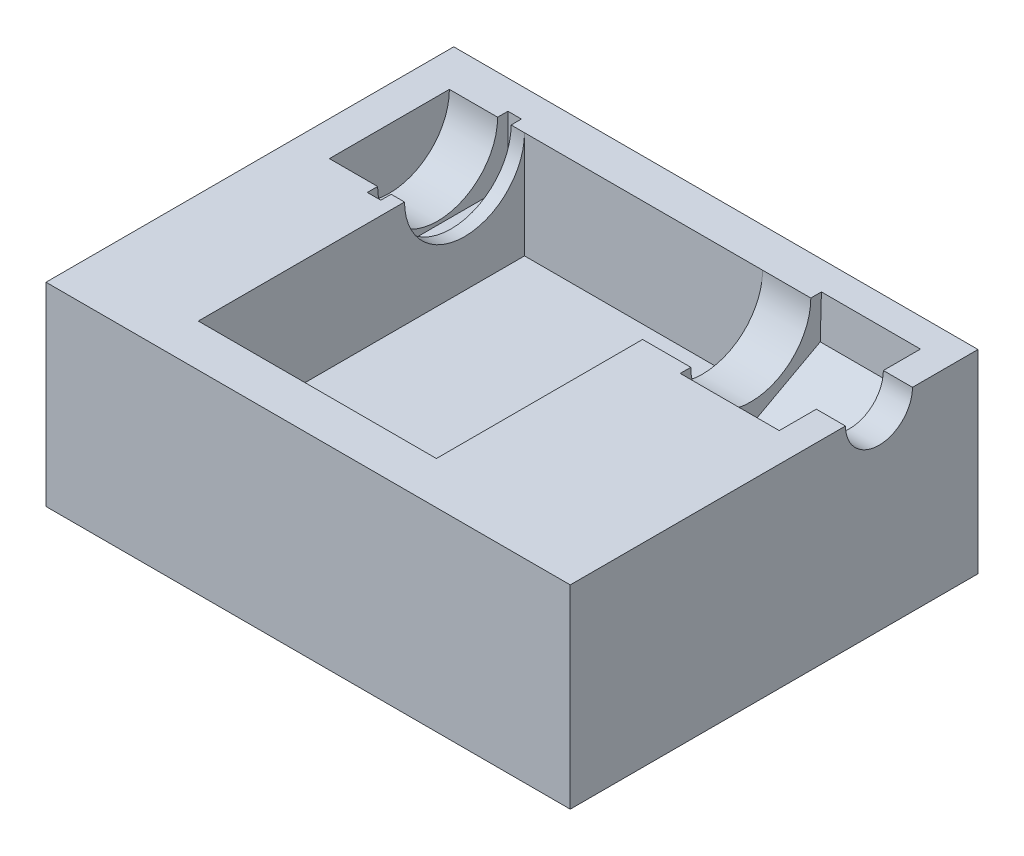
ISO-10303-21;
HEADER;
FILE_DESCRIPTION(('STEP AP214'),'2;1');
FILE_NAME('part.step','',(''),(''),'','','');
FILE_SCHEMA(('AUTOMOTIVE_DESIGN { 1 0 10303 214 1 1 1 1 }'));
ENDSEC;
DATA;
#1=APPLICATION_CONTEXT('core data for automotive mechanical design processes');
#2=APPLICATION_PROTOCOL_DEFINITION('international standard','automotive_design',2000,#1);
#3=PRODUCT_CONTEXT('',#1,'mechanical');
#4=PRODUCT('Part','Part','',(#3));
#5=PRODUCT_RELATED_PRODUCT_CATEGORY('part','',(#4));
#6=PRODUCT_DEFINITION_FORMATION('','',#4);
#7=PRODUCT_DEFINITION_CONTEXT('part definition',#1,'design');
#8=PRODUCT_DEFINITION('design','',#6,#7);
#9=PRODUCT_DEFINITION_SHAPE('','',#8);
#10=(LENGTH_UNIT() NAMED_UNIT(*) SI_UNIT(.MILLI.,.METRE.));
#11=(NAMED_UNIT(*) PLANE_ANGLE_UNIT() SI_UNIT($,.RADIAN.));
#12=(NAMED_UNIT(*) SI_UNIT($,.STERADIAN.) SOLID_ANGLE_UNIT());
#13=UNCERTAINTY_MEASURE_WITH_UNIT(LENGTH_MEASURE(1.E-05),#10,'distance_accuracy_value','');
#14=(GEOMETRIC_REPRESENTATION_CONTEXT(3) GLOBAL_UNCERTAINTY_ASSIGNED_CONTEXT((#13)) GLOBAL_UNIT_ASSIGNED_CONTEXT((#10,
#11,#12)) REPRESENTATION_CONTEXT('',''));
#15=CARTESIAN_POINT('',(0.,0.,0.));
#16=DIRECTION('',(0.,0.,1.));
#17=DIRECTION('',(1.,0.,0.));
#18=AXIS2_PLACEMENT_3D('',#15,#16,#17);
#19=CARTESIAN_POINT('',(45.,33.35,35.));
#20=DIRECTION('',(-1.,0.,0.));
#21=DIRECTION('',(0.,0.,1.));
#22=AXIS2_PLACEMENT_3D('',#19,#20,#21);
#23=PLANE('',#22);
#24=DIRECTION('',(0.,0.,-1.));
#25=VECTOR('',#24,1.);
#26=CARTESIAN_POINT('',(45.,33.35,35.));
#27=LINE('',#26,#25);
#28=CARTESIAN_POINT('',(45.,33.35,-23.75));
#29=VERTEX_POINT('',#28);
#30=CARTESIAN_POINT('',(45.,33.35,-35.));
#31=VERTEX_POINT('',#30);
#32=EDGE_CURVE('E324',#29,#31,#27,.T.);
#33=ORIENTED_EDGE('',*,*,#32,.F.);
#34=CARTESIAN_POINT('',(45.,33.35,-18.));
#35=DIRECTION('',(1.,0.,0.));
#36=DIRECTION('',(0.,0.,-1.));
#37=AXIS2_PLACEMENT_3D('',#34,#35,#36);
#38=CIRCLE('',#37,5.74999999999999);
#39=CARTESIAN_POINT('',(45.,33.35,-12.25));
#40=VERTEX_POINT('',#39);
#41=EDGE_CURVE('E318',#40,#29,#38,.T.);
#42=ORIENTED_EDGE('',*,*,#41,.F.);
#43=CARTESIAN_POINT('',(45.,33.35,35.));
#44=VERTEX_POINT('',#43);
#45=EDGE_CURVE('E320',#44,#40,#27,.T.);
#46=ORIENTED_EDGE('',*,*,#45,.F.);
#47=DIRECTION('',(0.,-1.,0.));
#48=VECTOR('',#47,1.);
#49=CARTESIAN_POINT('',(45.,33.35,35.));
#50=LINE('',#49,#48);
#51=CARTESIAN_POINT('',(45.,0.,35.));
#52=VERTEX_POINT('',#51);
#53=EDGE_CURVE('E330',#44,#52,#50,.T.);
#54=ORIENTED_EDGE('',*,*,#53,.T.);
#55=DIRECTION('',(0.,0.,-1.));
#56=VECTOR('',#55,1.);
#57=CARTESIAN_POINT('',(45.,0.,35.));
#58=LINE('',#57,#56);
#59=CARTESIAN_POINT('',(45.,0.,-35.));
#60=VERTEX_POINT('',#59);
#61=EDGE_CURVE('E317',#52,#60,#58,.T.);
#62=ORIENTED_EDGE('',*,*,#61,.T.);
#63=DIRECTION('',(0.,-1.,0.));
#64=VECTOR('',#63,1.);
#65=CARTESIAN_POINT('',(45.,33.35,-35.));
#66=LINE('',#65,#64);
#67=EDGE_CURVE('E347',#31,#60,#66,.T.);
#68=ORIENTED_EDGE('',*,*,#67,.F.);
#69=EDGE_LOOP('',(#33,#42,#46,#54,#62,#68));
#70=FACE_BOUND('',#69,.T.);
#71=ADVANCED_FACE('F34',(#70),#23,.F.);
#72=CARTESIAN_POINT('',(-45.,33.35,-35.));
#73=DIRECTION('',(0.,0.,1.));
#74=DIRECTION('',(1.,0.,0.));
#75=AXIS2_PLACEMENT_3D('',#72,#73,#74);
#76=PLANE('',#75);
#77=DIRECTION('',(-1.,0.,0.));
#78=VECTOR('',#77,1.);
#79=CARTESIAN_POINT('',(-45.,0.,-35.));
#80=LINE('',#79,#78);
#81=CARTESIAN_POINT('',(-45.,0.,-35.));
#82=VERTEX_POINT('',#81);
#83=EDGE_CURVE('E333',#60,#82,#80,.T.);
#84=ORIENTED_EDGE('',*,*,#83,.T.);
#85=DIRECTION('',(0.,-1.,0.));
#86=VECTOR('',#85,1.);
#87=CARTESIAN_POINT('',(-45.,33.35,-35.));
#88=LINE('',#87,#86);
#89=CARTESIAN_POINT('',(-45.,33.35,-35.));
#90=VERTEX_POINT('',#89);
#91=EDGE_CURVE('E344',#90,#82,#88,.T.);
#92=ORIENTED_EDGE('',*,*,#91,.F.);
#93=DIRECTION('',(-1.,0.,0.));
#94=VECTOR('',#93,1.);
#95=CARTESIAN_POINT('',(-45.,33.35,-35.));
#96=LINE('',#95,#94);
#97=EDGE_CURVE('E323',#31,#90,#96,.T.);
#98=ORIENTED_EDGE('',*,*,#97,.F.);
#99=ORIENTED_EDGE('',*,*,#67,.T.);
#100=EDGE_LOOP('',(#84,#92,#98,#99));
#101=FACE_BOUND('',#100,.T.);
#102=ADVANCED_FACE('F463',(#101),#76,.F.);
#103=CARTESIAN_POINT('',(-45.,33.35,35.));
#104=DIRECTION('',(1.,0.,0.));
#105=DIRECTION('',(0.,0.,-1.));
#106=AXIS2_PLACEMENT_3D('',#103,#104,#105);
#107=PLANE('',#106);
#108=DIRECTION('',(0.,0.,1.));
#109=VECTOR('',#108,1.);
#110=CARTESIAN_POINT('',(-45.,0.,35.));
#111=LINE('',#110,#109);
#112=CARTESIAN_POINT('',(-45.,0.,35.));
#113=VERTEX_POINT('',#112);
#114=EDGE_CURVE('E335',#82,#113,#111,.T.);
#115=ORIENTED_EDGE('',*,*,#114,.T.);
#116=DIRECTION('',(0.,-1.,0.));
#117=VECTOR('',#116,1.);
#118=CARTESIAN_POINT('',(-45.,33.35,35.));
#119=LINE('',#118,#117);
#120=CARTESIAN_POINT('',(-45.,33.35,35.));
#121=VERTEX_POINT('',#120);
#122=EDGE_CURVE('E341',#121,#113,#119,.T.);
#123=ORIENTED_EDGE('',*,*,#122,.F.);
#124=DIRECTION('',(0.,0.,1.));
#125=VECTOR('',#124,1.);
#126=CARTESIAN_POINT('',(-45.,33.35,35.));
#127=LINE('',#126,#125);
#128=EDGE_CURVE('E326',#90,#121,#127,.T.);
#129=ORIENTED_EDGE('',*,*,#128,.F.);
#130=ORIENTED_EDGE('',*,*,#91,.T.);
#131=EDGE_LOOP('',(#115,#123,#129,#130));
#132=FACE_BOUND('',#131,.T.);
#133=ADVANCED_FACE('F465',(#132),#107,.F.);
#134=CARTESIAN_POINT('',(-45.,33.35,35.));
#135=DIRECTION('',(0.,0.,-1.));
#136=DIRECTION('',(-1.,0.,0.));
#137=AXIS2_PLACEMENT_3D('',#134,#135,#136);
#138=PLANE('',#137);
#139=DIRECTION('',(1.,0.,0.));
#140=VECTOR('',#139,1.);
#141=CARTESIAN_POINT('',(-45.,0.,35.));
#142=LINE('',#141,#140);
#143=EDGE_CURVE('E337',#113,#52,#142,.T.);
#144=ORIENTED_EDGE('',*,*,#143,.T.);
#145=ORIENTED_EDGE('',*,*,#53,.F.);
#146=DIRECTION('',(1.,0.,0.));
#147=VECTOR('',#146,1.);
#148=CARTESIAN_POINT('',(-45.,33.35,35.));
#149=LINE('',#148,#147);
#150=EDGE_CURVE('E328',#121,#44,#149,.T.);
#151=ORIENTED_EDGE('',*,*,#150,.F.);
#152=ORIENTED_EDGE('',*,*,#122,.T.);
#153=EDGE_LOOP('',(#144,#145,#151,#152));
#154=FACE_BOUND('',#153,.T.);
#155=ADVANCED_FACE('F454',(#154),#138,.F.);
#156=CARTESIAN_POINT('',(0.,33.35,0.));
#157=DIRECTION('',(0.,-1.,0.));
#158=DIRECTION('',(0.,0.,-1.));
#159=AXIS2_PLACEMENT_3D('',#156,#157,#158);
#160=PLANE('',#159);
#161=DIRECTION('',(0.,0.,1.));
#162=VECTOR('',#161,1.);
#163=CARTESIAN_POINT('',(-39.05,33.35,0.));
#164=LINE('',#163,#162);
#165=CARTESIAN_POINT('',(-39.05,33.35,-28.3));
#166=VERTEX_POINT('',#165);
#167=CARTESIAN_POINT('',(-39.05,33.35,-7.7));
#168=VERTEX_POINT('',#167);
#169=EDGE_CURVE('E11',#166,#168,#164,.T.);
#170=ORIENTED_EDGE('',*,*,#169,.F.);
#171=DIRECTION('',(1.,0.,0.));
#172=VECTOR('',#171,1.);
#173=CARTESIAN_POINT('',(-39.05,33.35,-28.3));
#174=LINE('',#173,#172);
#175=CARTESIAN_POINT('',(-30.77,33.35,-28.3));
#176=VERTEX_POINT('',#175);
#177=EDGE_CURVE('E193',#166,#176,#174,.T.);
#178=ORIENTED_EDGE('',*,*,#177,.T.);
#179=DIRECTION('',(0.,0.,1.));
#180=VECTOR('',#179,1.);
#181=CARTESIAN_POINT('',(-30.77,33.35,0.));
#182=LINE('',#181,#180);
#183=CARTESIAN_POINT('',(-30.77,33.35,-30.07));
#184=VERTEX_POINT('',#183);
#185=EDGE_CURVE('E372',#184,#176,#182,.T.);
#186=ORIENTED_EDGE('',*,*,#185,.F.);
#187=DIRECTION('',(1.,0.,0.));
#188=VECTOR('',#187,1.);
#189=CARTESIAN_POINT('',(0.,33.35,-30.07));
#190=LINE('',#189,#188);
#191=CARTESIAN_POINT('',(-28.45,33.35,-30.07));
#192=VERTEX_POINT('',#191);
#193=EDGE_CURVE('E374',#184,#192,#190,.T.);
#194=ORIENTED_EDGE('',*,*,#193,.T.);
#195=DIRECTION('',(0.,0.,1.));
#196=VECTOR('',#195,1.);
#197=CARTESIAN_POINT('',(-28.45,33.35,0.));
#198=LINE('',#197,#196);
#199=CARTESIAN_POINT('',(-28.45,33.35,-28.3));
#200=VERTEX_POINT('',#199);
#201=EDGE_CURVE('E235',#192,#200,#198,.T.);
#202=ORIENTED_EDGE('',*,*,#201,.T.);
#203=DIRECTION('',(1.,0.,0.));
#204=VECTOR('',#203,1.);
#205=CARTESIAN_POINT('',(-28.45,33.35,-28.3));
#206=LINE('',#205,#204);
#207=CARTESIAN_POINT('',(-26.15,33.35,-28.3));
#208=VERTEX_POINT('',#207);
#209=EDGE_CURVE('E239',#200,#208,#206,.T.);
#210=ORIENTED_EDGE('',*,*,#209,.T.);
#211=DIRECTION('',(-1.,0.,0.));
#212=VECTOR('',#211,1.);
#213=CARTESIAN_POINT('',(14.72,33.35,-28.3));
#214=LINE('',#213,#212);
#215=CARTESIAN_POINT('',(14.72,33.35,-28.3));
#216=VERTEX_POINT('',#215);
#217=EDGE_CURVE('E242',#216,#208,#214,.T.);
#218=ORIENTED_EDGE('',*,*,#217,.F.);
#219=DIRECTION('',(1.,0.,0.));
#220=VECTOR('',#219,1.);
#221=CARTESIAN_POINT('',(14.72,33.35,-28.3));
#222=LINE('',#221,#220);
#223=CARTESIAN_POINT('',(23.,33.35,-28.3));
#224=VERTEX_POINT('',#223);
#225=EDGE_CURVE('E279',#216,#224,#222,.T.);
#226=ORIENTED_EDGE('',*,*,#225,.T.);
#227=DIRECTION('',(0.,0.,1.));
#228=VECTOR('',#227,1.);
#229=CARTESIAN_POINT('',(23.,33.35,0.));
#230=LINE('',#229,#228);
#231=CARTESIAN_POINT('',(23.,33.35,-30.1198274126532));
#232=VERTEX_POINT('',#231);
#233=EDGE_CURVE('E360',#232,#224,#230,.T.);
#234=ORIENTED_EDGE('',*,*,#233,.F.);
#235=DIRECTION('',(1.,0.,0.));
#236=VECTOR('',#235,1.);
#237=CARTESIAN_POINT('',(0.,33.35,-30.1198274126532));
#238=LINE('',#237,#236);
#239=CARTESIAN_POINT('',(40.,33.35,-30.1198274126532));
#240=VERTEX_POINT('',#239);
#241=EDGE_CURVE('E363',#232,#240,#238,.T.);
#242=ORIENTED_EDGE('',*,*,#241,.T.);
#243=DIRECTION('',(0.,0.,1.));
#244=VECTOR('',#243,1.);
#245=CARTESIAN_POINT('',(40.,33.35,0.));
#246=LINE('',#245,#244);
#247=CARTESIAN_POINT('',(40.,33.35,-23.75));
#248=VERTEX_POINT('',#247);
#249=EDGE_CURVE('E314',#240,#248,#246,.T.);
#250=ORIENTED_EDGE('',*,*,#249,.T.);
#251=DIRECTION('',(1.,0.,0.));
#252=VECTOR('',#251,1.);
#253=CARTESIAN_POINT('',(40.,33.35,-23.75));
#254=LINE('',#253,#252);
#255=EDGE_CURVE('E353',#248,#29,#254,.T.);
#256=ORIENTED_EDGE('',*,*,#255,.T.);
#257=ORIENTED_EDGE('',*,*,#32,.T.);
#258=ORIENTED_EDGE('',*,*,#97,.T.);
#259=ORIENTED_EDGE('',*,*,#128,.T.);
#260=ORIENTED_EDGE('',*,*,#150,.T.);
#261=ORIENTED_EDGE('',*,*,#45,.T.);
#262=DIRECTION('',(1.,0.,0.));
#263=VECTOR('',#262,1.);
#264=CARTESIAN_POINT('',(40.,33.35,-12.25));
#265=LINE('',#264,#263);
#266=CARTESIAN_POINT('',(40.,33.35,-12.25));
#267=VERTEX_POINT('',#266);
#268=EDGE_CURVE('E350',#40,#267,#265,.F.);
#269=ORIENTED_EDGE('',*,*,#268,.T.);
#270=CARTESIAN_POINT('',(40.,33.35,-5.88017258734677));
#271=VERTEX_POINT('',#270);
#272=EDGE_CURVE('E307',#267,#271,#246,.T.);
#273=ORIENTED_EDGE('',*,*,#272,.T.);
#274=DIRECTION('',(-1.,0.,0.));
#275=VECTOR('',#274,1.);
#276=CARTESIAN_POINT('',(0.,33.35,-5.88017258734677));
#277=LINE('',#276,#275);
#278=CARTESIAN_POINT('',(23.,33.35,-5.88017258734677));
#279=VERTEX_POINT('',#278);
#280=EDGE_CURVE('E356',#271,#279,#277,.T.);
#281=ORIENTED_EDGE('',*,*,#280,.T.);
#282=CARTESIAN_POINT('',(23.,33.35,-7.69999999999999));
#283=VERTEX_POINT('',#282);
#284=EDGE_CURVE('E359',#283,#279,#230,.T.);
#285=ORIENTED_EDGE('',*,*,#284,.F.);
#286=DIRECTION('',(1.,0.,0.));
#287=VECTOR('',#286,1.);
#288=CARTESIAN_POINT('',(14.72,33.35,-7.69999999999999));
#289=LINE('',#288,#287);
#290=CARTESIAN_POINT('',(14.72,33.35,-7.69999999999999));
#291=VERTEX_POINT('',#290);
#292=EDGE_CURVE('E276',#283,#291,#289,.F.);
#293=ORIENTED_EDGE('',*,*,#292,.T.);
#294=DIRECTION('',(0.,0.,1.));
#295=VECTOR('',#294,1.);
#296=CARTESIAN_POINT('',(14.72,33.35,-28.3));
#297=LINE('',#296,#295);
#298=CARTESIAN_POINT('',(14.72,33.35,27.7));
#299=VERTEX_POINT('',#298);
#300=EDGE_CURVE('E247',#291,#299,#297,.T.);
#301=ORIENTED_EDGE('',*,*,#300,.T.);
#302=DIRECTION('',(-1.,0.,0.));
#303=VECTOR('',#302,1.);
#304=CARTESIAN_POINT('',(14.72,33.35,27.7));
#305=LINE('',#304,#303);
#306=CARTESIAN_POINT('',(-26.15,33.35,27.7));
#307=VERTEX_POINT('',#306);
#308=EDGE_CURVE('E259',#299,#307,#305,.T.);
#309=ORIENTED_EDGE('',*,*,#308,.T.);
#310=DIRECTION('',(0.,0.,1.));
#311=VECTOR('',#310,1.);
#312=CARTESIAN_POINT('',(-26.15,33.35,-28.3));
#313=LINE('',#312,#311);
#314=CARTESIAN_POINT('',(-26.15,33.35,-7.7));
#315=VERTEX_POINT('',#314);
#316=EDGE_CURVE('E257',#315,#307,#313,.T.);
#317=ORIENTED_EDGE('',*,*,#316,.F.);
#318=DIRECTION('',(1.,0.,0.));
#319=VECTOR('',#318,1.);
#320=CARTESIAN_POINT('',(-28.45,33.35,-7.7));
#321=LINE('',#320,#319);
#322=CARTESIAN_POINT('',(-28.45,33.35,-7.7));
#323=VERTEX_POINT('',#322);
#324=EDGE_CURVE('E56',#315,#323,#321,.F.);
#325=ORIENTED_EDGE('',*,*,#324,.T.);
#326=CARTESIAN_POINT('',(-28.45,33.35,-5.93));
#327=VERTEX_POINT('',#326);
#328=EDGE_CURVE('E230',#323,#327,#198,.T.);
#329=ORIENTED_EDGE('',*,*,#328,.T.);
#330=DIRECTION('',(-1.,0.,0.));
#331=VECTOR('',#330,1.);
#332=CARTESIAN_POINT('',(0.,33.35,-5.93000000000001));
#333=LINE('',#332,#331);
#334=CARTESIAN_POINT('',(-30.77,33.35,-5.93));
#335=VERTEX_POINT('',#334);
#336=EDGE_CURVE('E370',#327,#335,#333,.T.);
#337=ORIENTED_EDGE('',*,*,#336,.T.);
#338=CARTESIAN_POINT('',(-30.77,33.35,-7.7));
#339=VERTEX_POINT('',#338);
#340=EDGE_CURVE('E209',#339,#335,#182,.T.);
#341=ORIENTED_EDGE('',*,*,#340,.F.);
#342=DIRECTION('',(1.,0.,0.));
#343=VECTOR('',#342,1.);
#344=CARTESIAN_POINT('',(-39.05,33.35,-7.7));
#345=LINE('',#344,#343);
#346=EDGE_CURVE('E48',#339,#168,#345,.F.);
#347=ORIENTED_EDGE('',*,*,#346,.T.);
#348=EDGE_LOOP('',(#170,#178,#186,#194,#202,#210,#218,#226,#234,#242,#250,#256,#257,#258,#259,
#260,#261,#269,#273,#281,#285,#293,#301,#309,#317,#325,#329,#337,#341,#347));
#349=FACE_BOUND('',#348,.T.);
#350=ADVANCED_FACE('F206',(#349),#160,.F.);
#351=CARTESIAN_POINT('',(0.,0.,0.));
#352=DIRECTION('',(0.,-1.,0.));
#353=DIRECTION('',(0.,0.,-1.));
#354=AXIS2_PLACEMENT_3D('',#351,#352,#353);
#355=PLANE('',#354);
#356=ORIENTED_EDGE('',*,*,#61,.F.);
#357=ORIENTED_EDGE('',*,*,#143,.F.);
#358=ORIENTED_EDGE('',*,*,#114,.F.);
#359=ORIENTED_EDGE('',*,*,#83,.F.);
#360=EDGE_LOOP('',(#356,#357,#358,#359));
#361=FACE_BOUND('',#360,.T.);
#362=ADVANCED_FACE('F458',(#361),#355,.T.);
#363=CARTESIAN_POINT('',(40.,33.35,-18.));
#364=DIRECTION('',(1.,0.,0.));
#365=DIRECTION('',(0.,0.,-1.));
#366=AXIS2_PLACEMENT_3D('',#363,#364,#365);
#367=CYLINDRICAL_SURFACE('',#366,5.74999999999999);
#368=CARTESIAN_POINT('',(40.,33.35,-18.));
#369=DIRECTION('',(1.,0.,0.));
#370=DIRECTION('',(0.,0.,-1.));
#371=AXIS2_PLACEMENT_3D('',#368,#369,#370);
#372=CIRCLE('',#371,5.74999999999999);
#373=EDGE_CURVE('E315',#267,#248,#372,.T.);
#374=ORIENTED_EDGE('',*,*,#373,.F.);
#375=ORIENTED_EDGE('',*,*,#268,.F.);
#376=ORIENTED_EDGE('',*,*,#41,.T.);
#377=ORIENTED_EDGE('',*,*,#255,.F.);
#378=EDGE_LOOP('',(#374,#375,#376,#377));
#379=FACE_BOUND('',#378,.T.);
#380=ADVANCED_FACE('F444',(#379),#367,.F.);
#381=CARTESIAN_POINT('',(23.,26.0227552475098,-29.9170115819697));
#382=DIRECTION('',(0.,-0.0276690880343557,-0.999617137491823));
#383=DIRECTION('',(0.,0.999617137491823,-0.0276690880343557));
#384=AXIS2_PLACEMENT_3D('',#381,#382,#383);
#385=PLANE('',#384);
#386=DIRECTION('',(0.,0.999617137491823,-0.0276690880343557));
#387=VECTOR('',#386,1.);
#388=CARTESIAN_POINT('',(23.,26.0227552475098,-29.9170115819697));
#389=LINE('',#388,#387);
#390=CARTESIAN_POINT('',(23.,26.0227552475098,-29.9170115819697));
#391=VERTEX_POINT('',#390);
#392=EDGE_CURVE('E283',#391,#232,#389,.T.);
#393=ORIENTED_EDGE('',*,*,#392,.F.);
#394=DIRECTION('',(1.,0.,0.));
#395=VECTOR('',#394,1.);
#396=CARTESIAN_POINT('',(23.,26.0227552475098,-29.9170115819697));
#397=LINE('',#396,#395);
#398=CARTESIAN_POINT('',(40.,26.0227552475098,-29.9170115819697));
#399=VERTEX_POINT('',#398);
#400=EDGE_CURVE('E305',#391,#399,#397,.T.);
#401=ORIENTED_EDGE('',*,*,#400,.T.);
#402=DIRECTION('',(0.,0.999617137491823,-0.0276690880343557));
#403=VECTOR('',#402,1.);
#404=CARTESIAN_POINT('',(40.,26.0227552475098,-29.9170115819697));
#405=LINE('',#404,#403);
#406=EDGE_CURVE('E282',#399,#240,#405,.T.);
#407=ORIENTED_EDGE('',*,*,#406,.T.);
#408=ORIENTED_EDGE('',*,*,#241,.F.);
#409=EDGE_LOOP('',(#393,#401,#407,#408));
#410=FACE_BOUND('',#409,.T.);
#411=ADVANCED_FACE('F439',(#410),#385,.F.);
#412=CARTESIAN_POINT('',(23.,40.6772447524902,-6.08298841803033));
#413=DIRECTION('',(0.,0.0276690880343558,0.999617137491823));
#414=DIRECTION('',(0.,-0.999617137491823,0.0276690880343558));
#415=AXIS2_PLACEMENT_3D('',#412,#413,#414);
#416=PLANE('',#415);
#417=DIRECTION('',(0.,-0.999617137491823,0.0276690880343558));
#418=VECTOR('',#417,1.);
#419=CARTESIAN_POINT('',(40.,40.6772447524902,-6.08298841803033));
#420=LINE('',#419,#418);
#421=CARTESIAN_POINT('',(40.,26.693187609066,-5.69591411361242));
#422=VERTEX_POINT('',#421);
#423=EDGE_CURVE('E298',#271,#422,#420,.T.);
#424=ORIENTED_EDGE('',*,*,#423,.T.);
#425=DIRECTION('',(1.,0.,0.));
#426=VECTOR('',#425,1.);
#427=CARTESIAN_POINT('',(23.,26.693187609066,-5.69591411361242));
#428=LINE('',#427,#426);
#429=CARTESIAN_POINT('',(23.,26.693187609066,-5.69591411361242));
#430=VERTEX_POINT('',#429);
#431=EDGE_CURVE('E295',#430,#422,#428,.T.);
#432=ORIENTED_EDGE('',*,*,#431,.F.);
#433=DIRECTION('',(0.,-0.999617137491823,0.0276690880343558));
#434=VECTOR('',#433,1.);
#435=CARTESIAN_POINT('',(23.,40.6772447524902,-6.08298841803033));
#436=LINE('',#435,#434);
#437=EDGE_CURVE('E286',#279,#430,#436,.T.);
#438=ORIENTED_EDGE('',*,*,#437,.F.);
#439=ORIENTED_EDGE('',*,*,#280,.F.);
#440=EDGE_LOOP('',(#424,#432,#438,#439));
#441=FACE_BOUND('',#440,.T.);
#442=ADVANCED_FACE('F423',(#441),#416,.F.);
#443=CARTESIAN_POINT('',(23.,0.,0.));
#444=DIRECTION('',(1.,0.,0.));
#445=DIRECTION('',(0.,0.,-1.));
#446=AXIS2_PLACEMENT_3D('',#443,#444,#445);
#447=PLANE('',#446);
#448=CARTESIAN_POINT('',(23.,33.35,-18.));
#449=DIRECTION('',(1.,0.,0.));
#450=DIRECTION('',(0.,0.,-1.));
#451=AXIS2_PLACEMENT_3D('',#448,#449,#450);
#452=CIRCLE('',#451,10.3);
#453=EDGE_CURVE('E366',#283,#224,#452,.T.);
#454=ORIENTED_EDGE('',*,*,#453,.F.);
#455=ORIENTED_EDGE('',*,*,#284,.T.);
#456=ORIENTED_EDGE('',*,*,#437,.T.);
#457=DIRECTION('',(0.,-0.523770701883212,-0.851859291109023));
#458=VECTOR('',#457,1.);
#459=CARTESIAN_POINT('',(23.,26.693187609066,-5.69591411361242));
#460=LINE('',#459,#458);
#461=CARTESIAN_POINT('',(23.,19.3659428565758,-17.6129256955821));
#462=VERTEX_POINT('',#461);
#463=EDGE_CURVE('E289',#430,#462,#460,.T.);
#464=ORIENTED_EDGE('',*,*,#463,.T.);
#465=DIRECTION('',(0.,0.475846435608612,-0.879528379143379));
#466=VECTOR('',#465,1.);
#467=CARTESIAN_POINT('',(23.,19.3659428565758,-17.6129256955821));
#468=LINE('',#467,#466);
#469=EDGE_CURVE('E292',#462,#391,#468,.T.);
#470=ORIENTED_EDGE('',*,*,#469,.T.);
#471=ORIENTED_EDGE('',*,*,#392,.T.);
#472=ORIENTED_EDGE('',*,*,#233,.T.);
#473=EDGE_LOOP('',(#454,#455,#456,#464,#470,#471,#472));
#474=FACE_BOUND('',#473,.T.);
#475=ADVANCED_FACE('F419',(#474),#447,.T.);
#476=CARTESIAN_POINT('',(40.,0.,0.));
#477=DIRECTION('',(1.,0.,0.));
#478=DIRECTION('',(0.,0.,-1.));
#479=AXIS2_PLACEMENT_3D('',#476,#477,#478);
#480=PLANE('',#479);
#481=ORIENTED_EDGE('',*,*,#406,.F.);
#482=DIRECTION('',(0.,0.475846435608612,-0.879528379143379));
#483=VECTOR('',#482,1.);
#484=CARTESIAN_POINT('',(40.,19.3659428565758,-17.6129256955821));
#485=LINE('',#484,#483);
#486=CARTESIAN_POINT('',(40.,19.3659428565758,-17.6129256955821));
#487=VERTEX_POINT('',#486);
#488=EDGE_CURVE('E287',#487,#399,#485,.T.);
#489=ORIENTED_EDGE('',*,*,#488,.F.);
#490=DIRECTION('',(0.,-0.523770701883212,-0.851859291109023));
#491=VECTOR('',#490,1.);
#492=CARTESIAN_POINT('',(40.,26.693187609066,-5.69591411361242));
#493=LINE('',#492,#491);
#494=EDGE_CURVE('E300',#422,#487,#493,.T.);
#495=ORIENTED_EDGE('',*,*,#494,.F.);
#496=ORIENTED_EDGE('',*,*,#423,.F.);
#497=ORIENTED_EDGE('',*,*,#272,.F.);
#498=ORIENTED_EDGE('',*,*,#373,.T.);
#499=ORIENTED_EDGE('',*,*,#249,.F.);
#500=EDGE_LOOP('',(#481,#489,#495,#496,#497,#498,#499));
#501=FACE_BOUND('',#500,.T.);
#502=ADVANCED_FACE('F428',(#501),#480,.F.);
#503=CARTESIAN_POINT('',(23.,19.3659428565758,-17.6129256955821));
#504=DIRECTION('',(0.,-0.879528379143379,-0.475846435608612));
#505=DIRECTION('',(0.,0.475846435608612,-0.879528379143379));
#506=AXIS2_PLACEMENT_3D('',#503,#504,#505);
#507=PLANE('',#506);
#508=ORIENTED_EDGE('',*,*,#488,.T.);
#509=ORIENTED_EDGE('',*,*,#400,.F.);
#510=ORIENTED_EDGE('',*,*,#469,.F.);
#511=DIRECTION('',(1.,0.,0.));
#512=VECTOR('',#511,1.);
#513=CARTESIAN_POINT('',(23.,19.3659428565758,-17.6129256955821));
#514=LINE('',#513,#512);
#515=EDGE_CURVE('E308',#462,#487,#514,.T.);
#516=ORIENTED_EDGE('',*,*,#515,.T.);
#517=EDGE_LOOP('',(#508,#509,#510,#516));
#518=FACE_BOUND('',#517,.T.);
#519=ADVANCED_FACE('F436',(#518),#507,.F.);
#520=CARTESIAN_POINT('',(23.,26.693187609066,-5.69591411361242));
#521=DIRECTION('',(0.,-0.851859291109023,0.523770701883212));
#522=DIRECTION('',(0.,-0.523770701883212,-0.851859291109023));
#523=AXIS2_PLACEMENT_3D('',#520,#521,#522);
#524=PLANE('',#523);
#525=ORIENTED_EDGE('',*,*,#494,.T.);
#526=ORIENTED_EDGE('',*,*,#515,.F.);
#527=ORIENTED_EDGE('',*,*,#463,.F.);
#528=ORIENTED_EDGE('',*,*,#431,.T.);
#529=EDGE_LOOP('',(#525,#526,#527,#528));
#530=FACE_BOUND('',#529,.T.);
#531=ADVANCED_FACE('F432',(#530),#524,.F.);
#532=CARTESIAN_POINT('',(14.72,33.35,-18.));
#533=DIRECTION('',(1.,0.,0.));
#534=DIRECTION('',(0.,0.,-1.));
#535=AXIS2_PLACEMENT_3D('',#532,#533,#534);
#536=CYLINDRICAL_SURFACE('',#535,10.3);
#537=CARTESIAN_POINT('',(14.72,33.35,-18.));
#538=DIRECTION('',(1.,0.,0.));
#539=DIRECTION('',(0.,0.,-1.));
#540=AXIS2_PLACEMENT_3D('',#537,#538,#539);
#541=CIRCLE('',#540,10.3);
#542=EDGE_CURVE('E267',#291,#216,#541,.T.);
#543=ORIENTED_EDGE('',*,*,#542,.F.);
#544=ORIENTED_EDGE('',*,*,#292,.F.);
#545=ORIENTED_EDGE('',*,*,#453,.T.);
#546=ORIENTED_EDGE('',*,*,#225,.F.);
#547=EDGE_LOOP('',(#543,#544,#545,#546));
#548=FACE_BOUND('',#547,.T.);
#549=ADVANCED_FACE('F415',(#548),#536,.F.);
#550=CARTESIAN_POINT('',(14.72,15.035,-28.3));
#551=DIRECTION('',(-1.,0.,0.));
#552=DIRECTION('',(0.,0.,1.));
#553=AXIS2_PLACEMENT_3D('',#550,#551,#552);
#554=PLANE('',#553);
#555=ORIENTED_EDGE('',*,*,#542,.T.);
#556=DIRECTION('',(0.,1.,0.));
#557=VECTOR('',#556,1.);
#558=CARTESIAN_POINT('',(14.72,15.035,-28.3));
#559=LINE('',#558,#557);
#560=CARTESIAN_POINT('',(14.72,15.035,-28.3));
#561=VERTEX_POINT('',#560);
#562=EDGE_CURVE('E264',#561,#216,#559,.T.);
#563=ORIENTED_EDGE('',*,*,#562,.F.);
#564=DIRECTION('',(0.,0.,1.));
#565=VECTOR('',#564,1.);
#566=CARTESIAN_POINT('',(14.72,15.035,-28.3));
#567=LINE('',#566,#565);
#568=CARTESIAN_POINT('',(14.72,15.035,27.7));
#569=VERTEX_POINT('',#568);
#570=EDGE_CURVE('E252',#561,#569,#567,.T.);
#571=ORIENTED_EDGE('',*,*,#570,.T.);
#572=DIRECTION('',(0.,1.,0.));
#573=VECTOR('',#572,1.);
#574=CARTESIAN_POINT('',(14.72,15.035,27.7));
#575=LINE('',#574,#573);
#576=EDGE_CURVE('E268',#569,#299,#575,.T.);
#577=ORIENTED_EDGE('',*,*,#576,.T.);
#578=ORIENTED_EDGE('',*,*,#300,.F.);
#579=EDGE_LOOP('',(#555,#563,#571,#577,#578));
#580=FACE_BOUND('',#579,.T.);
#581=ADVANCED_FACE('F552',(#580),#554,.T.);
#582=CARTESIAN_POINT('',(14.72,15.035,-28.3));
#583=DIRECTION('',(0.,0.,-1.));
#584=DIRECTION('',(-1.,0.,0.));
#585=AXIS2_PLACEMENT_3D('',#582,#583,#584);
#586=PLANE('',#585);
#587=ORIENTED_EDGE('',*,*,#217,.T.);
#588=DIRECTION('',(0.,1.,0.));
#589=VECTOR('',#588,1.);
#590=CARTESIAN_POINT('',(-26.15,15.035,-28.3));
#591=LINE('',#590,#589);
#592=CARTESIAN_POINT('',(-26.15,15.035,-28.3));
#593=VERTEX_POINT('',#592);
#594=EDGE_CURVE('E254',#593,#208,#591,.T.);
#595=ORIENTED_EDGE('',*,*,#594,.F.);
#596=DIRECTION('',(-1.,0.,0.));
#597=VECTOR('',#596,1.);
#598=CARTESIAN_POINT('',(14.72,15.035,-28.3));
#599=LINE('',#598,#597);
#600=EDGE_CURVE('E243',#561,#593,#599,.T.);
#601=ORIENTED_EDGE('',*,*,#600,.F.);
#602=ORIENTED_EDGE('',*,*,#562,.T.);
#603=EDGE_LOOP('',(#587,#595,#601,#602));
#604=FACE_BOUND('',#603,.T.);
#605=ADVANCED_FACE('F410',(#604),#586,.F.);
#606=CARTESIAN_POINT('',(14.72,15.035,27.7));
#607=DIRECTION('',(0.,0.,-1.));
#608=DIRECTION('',(-1.,0.,0.));
#609=AXIS2_PLACEMENT_3D('',#606,#607,#608);
#610=PLANE('',#609);
#611=ORIENTED_EDGE('',*,*,#308,.F.);
#612=ORIENTED_EDGE('',*,*,#576,.F.);
#613=DIRECTION('',(-1.,0.,0.));
#614=VECTOR('',#613,1.);
#615=CARTESIAN_POINT('',(14.72,15.035,27.7));
#616=LINE('',#615,#614);
#617=CARTESIAN_POINT('',(-26.15,15.035,27.7));
#618=VERTEX_POINT('',#617);
#619=EDGE_CURVE('E250',#569,#618,#616,.T.);
#620=ORIENTED_EDGE('',*,*,#619,.T.);
#621=DIRECTION('',(0.,1.,0.));
#622=VECTOR('',#621,1.);
#623=CARTESIAN_POINT('',(-26.15,15.035,27.7));
#624=LINE('',#623,#622);
#625=EDGE_CURVE('E270',#618,#307,#624,.T.);
#626=ORIENTED_EDGE('',*,*,#625,.T.);
#627=EDGE_LOOP('',(#611,#612,#620,#626));
#628=FACE_BOUND('',#627,.T.);
#629=ADVANCED_FACE('F401',(#628),#610,.T.);
#630=CARTESIAN_POINT('',(-26.15,15.035,-28.3));
#631=DIRECTION('',(-1.,0.,0.));
#632=DIRECTION('',(0.,0.,1.));
#633=AXIS2_PLACEMENT_3D('',#630,#631,#632);
#634=PLANE('',#633);
#635=ORIENTED_EDGE('',*,*,#594,.T.);
#636=CARTESIAN_POINT('',(-26.15,33.35,-18.));
#637=DIRECTION('',(-1.,0.,0.));
#638=DIRECTION('',(0.,0.,1.));
#639=AXIS2_PLACEMENT_3D('',#636,#637,#638);
#640=CIRCLE('',#639,10.3);
#641=EDGE_CURVE('E368',#208,#315,#640,.T.);
#642=ORIENTED_EDGE('',*,*,#641,.T.);
#643=ORIENTED_EDGE('',*,*,#316,.T.);
#644=ORIENTED_EDGE('',*,*,#625,.F.);
#645=DIRECTION('',(0.,0.,1.));
#646=VECTOR('',#645,1.);
#647=CARTESIAN_POINT('',(-26.15,15.035,-28.3));
#648=LINE('',#647,#646);
#649=EDGE_CURVE('E246',#593,#618,#648,.T.);
#650=ORIENTED_EDGE('',*,*,#649,.F.);
#651=EDGE_LOOP('',(#635,#642,#643,#644,#650));
#652=FACE_BOUND('',#651,.T.);
#653=ADVANCED_FACE('F398',(#652),#634,.F.);
#654=CARTESIAN_POINT('',(0.,15.035,0.));
#655=DIRECTION('',(0.,1.,0.));
#656=DIRECTION('',(0.,0.,1.));
#657=AXIS2_PLACEMENT_3D('',#654,#655,#656);
#658=PLANE('',#657);
#659=ORIENTED_EDGE('',*,*,#600,.T.);
#660=ORIENTED_EDGE('',*,*,#649,.T.);
#661=ORIENTED_EDGE('',*,*,#619,.F.);
#662=ORIENTED_EDGE('',*,*,#570,.F.);
#663=EDGE_LOOP('',(#659,#660,#661,#662));
#664=FACE_BOUND('',#663,.T.);
#665=ADVANCED_FACE('F406',(#664),#658,.T.);
#666=CARTESIAN_POINT('',(-28.45,33.35,-18.));
#667=DIRECTION('',(1.,0.,0.));
#668=DIRECTION('',(0.,0.,-1.));
#669=AXIS2_PLACEMENT_3D('',#666,#667,#668);
#670=CYLINDRICAL_SURFACE('',#669,10.3);
#671=CARTESIAN_POINT('',(-28.45,33.35,-18.));
#672=DIRECTION('',(1.,0.,0.));
#673=DIRECTION('',(0.,0.,-1.));
#674=AXIS2_PLACEMENT_3D('',#671,#672,#673);
#675=CIRCLE('',#674,10.3);
#676=EDGE_CURVE('E236',#323,#200,#675,.T.);
#677=ORIENTED_EDGE('',*,*,#676,.F.);
#678=ORIENTED_EDGE('',*,*,#324,.F.);
#679=ORIENTED_EDGE('',*,*,#641,.F.);
#680=ORIENTED_EDGE('',*,*,#209,.F.);
#681=EDGE_LOOP('',(#677,#678,#679,#680));
#682=FACE_BOUND('',#681,.T.);
#683=ADVANCED_FACE('F393',(#682),#670,.F.);
#684=CARTESIAN_POINT('',(-30.77,22.45,-5.93));
#685=DIRECTION('',(0.,0.,1.));
#686=DIRECTION('',(1.,0.,0.));
#687=AXIS2_PLACEMENT_3D('',#684,#685,#686);
#688=PLANE('',#687);
#689=DIRECTION('',(0.,-1.,0.));
#690=VECTOR('',#689,1.);
#691=CARTESIAN_POINT('',(-28.45,22.45,-5.93));
#692=LINE('',#691,#690);
#693=CARTESIAN_POINT('',(-28.45,22.45,-5.93));
#694=VERTEX_POINT('',#693);
#695=EDGE_CURVE('E201',#327,#694,#692,.T.);
#696=ORIENTED_EDGE('',*,*,#695,.T.);
#697=DIRECTION('',(1.,0.,0.));
#698=VECTOR('',#697,1.);
#699=CARTESIAN_POINT('',(-30.77,22.45,-5.93));
#700=LINE('',#699,#698);
#701=CARTESIAN_POINT('',(-30.77,22.45,-5.93));
#702=VERTEX_POINT('',#701);
#703=EDGE_CURVE('E221',#702,#694,#700,.T.);
#704=ORIENTED_EDGE('',*,*,#703,.F.);
#705=DIRECTION('',(0.,-1.,0.));
#706=VECTOR('',#705,1.);
#707=CARTESIAN_POINT('',(-30.77,22.45,-5.93));
#708=LINE('',#707,#706);
#709=EDGE_CURVE('E212',#335,#702,#708,.T.);
#710=ORIENTED_EDGE('',*,*,#709,.F.);
#711=ORIENTED_EDGE('',*,*,#336,.F.);
#712=EDGE_LOOP('',(#696,#704,#710,#711));
#713=FACE_BOUND('',#712,.T.);
#714=ADVANCED_FACE('F590',(#713),#688,.F.);
#715=CARTESIAN_POINT('',(-30.77,22.45,-30.07));
#716=DIRECTION('',(0.,0.,-1.));
#717=DIRECTION('',(-1.,0.,0.));
#718=AXIS2_PLACEMENT_3D('',#715,#716,#717);
#719=PLANE('',#718);
#720=DIRECTION('',(0.,1.,0.));
#721=VECTOR('',#720,1.);
#722=CARTESIAN_POINT('',(-30.77,22.45,-30.07));
#723=LINE('',#722,#721);
#724=CARTESIAN_POINT('',(-30.77,22.45,-30.07));
#725=VERTEX_POINT('',#724);
#726=EDGE_CURVE('E218',#725,#184,#723,.T.);
#727=ORIENTED_EDGE('',*,*,#726,.F.);
#728=DIRECTION('',(1.,0.,0.));
#729=VECTOR('',#728,1.);
#730=CARTESIAN_POINT('',(-30.77,22.45,-30.07));
#731=LINE('',#730,#729);
#732=CARTESIAN_POINT('',(-28.45,22.45,-30.07));
#733=VERTEX_POINT('',#732);
#734=EDGE_CURVE('E228',#725,#733,#731,.T.);
#735=ORIENTED_EDGE('',*,*,#734,.T.);
#736=DIRECTION('',(0.,1.,0.));
#737=VECTOR('',#736,1.);
#738=CARTESIAN_POINT('',(-28.45,22.45,-30.07));
#739=LINE('',#738,#737);
#740=EDGE_CURVE('E215',#733,#192,#739,.T.);
#741=ORIENTED_EDGE('',*,*,#740,.T.);
#742=ORIENTED_EDGE('',*,*,#193,.F.);
#743=EDGE_LOOP('',(#727,#735,#741,#742));
#744=FACE_BOUND('',#743,.T.);
#745=ADVANCED_FACE('F380',(#744),#719,.F.);
#746=CARTESIAN_POINT('',(-30.77,0.,0.));
#747=DIRECTION('',(1.,0.,0.));
#748=DIRECTION('',(0.,0.,-1.));
#749=AXIS2_PLACEMENT_3D('',#746,#747,#748);
#750=PLANE('',#749);
#751=CARTESIAN_POINT('',(-30.77,33.35,-18.));
#752=DIRECTION('',(1.,0.,0.));
#753=DIRECTION('',(0.,0.,-1.));
#754=AXIS2_PLACEMENT_3D('',#751,#752,#753);
#755=CIRCLE('',#754,10.3);
#756=EDGE_CURVE('E41',#339,#176,#755,.T.);
#757=ORIENTED_EDGE('',*,*,#756,.F.);
#758=ORIENTED_EDGE('',*,*,#340,.T.);
#759=ORIENTED_EDGE('',*,*,#709,.T.);
#760=DIRECTION('',(0.,0.,-1.));
#761=VECTOR('',#760,1.);
#762=CARTESIAN_POINT('',(-30.77,22.45,-30.07));
#763=LINE('',#762,#761);
#764=EDGE_CURVE('E214',#702,#725,#763,.T.);
#765=ORIENTED_EDGE('',*,*,#764,.T.);
#766=ORIENTED_EDGE('',*,*,#726,.T.);
#767=ORIENTED_EDGE('',*,*,#185,.T.);
#768=EDGE_LOOP('',(#757,#758,#759,#765,#766,#767));
#769=FACE_BOUND('',#768,.T.);
#770=ADVANCED_FACE('F383',(#769),#750,.T.);
#771=CARTESIAN_POINT('',(-28.45,0.,0.));
#772=DIRECTION('',(1.,0.,0.));
#773=DIRECTION('',(0.,0.,-1.));
#774=AXIS2_PLACEMENT_3D('',#771,#772,#773);
#775=PLANE('',#774);
#776=ORIENTED_EDGE('',*,*,#740,.F.);
#777=DIRECTION('',(0.,0.,-1.));
#778=VECTOR('',#777,1.);
#779=CARTESIAN_POINT('',(-28.45,22.45,-30.07));
#780=LINE('',#779,#778);
#781=EDGE_CURVE('E223',#694,#733,#780,.T.);
#782=ORIENTED_EDGE('',*,*,#781,.F.);
#783=ORIENTED_EDGE('',*,*,#695,.F.);
#784=ORIENTED_EDGE('',*,*,#328,.F.);
#785=ORIENTED_EDGE('',*,*,#676,.T.);
#786=ORIENTED_EDGE('',*,*,#201,.F.);
#787=EDGE_LOOP('',(#776,#782,#783,#784,#785,#786));
#788=FACE_BOUND('',#787,.T.);
#789=ADVANCED_FACE('F391',(#788),#775,.F.);
#790=CARTESIAN_POINT('',(-30.77,22.45,-30.07));
#791=DIRECTION('',(0.,-1.,0.));
#792=DIRECTION('',(0.,0.,-1.));
#793=AXIS2_PLACEMENT_3D('',#790,#791,#792);
#794=PLANE('',#793);
#795=ORIENTED_EDGE('',*,*,#781,.T.);
#796=ORIENTED_EDGE('',*,*,#734,.F.);
#797=ORIENTED_EDGE('',*,*,#764,.F.);
#798=ORIENTED_EDGE('',*,*,#703,.T.);
#799=EDGE_LOOP('',(#795,#796,#797,#798));
#800=FACE_BOUND('',#799,.T.);
#801=ADVANCED_FACE('F388',(#800),#794,.F.);
#802=CARTESIAN_POINT('',(-39.05,33.35,-18.));
#803=DIRECTION('',(1.,0.,0.));
#804=DIRECTION('',(0.,0.,-1.));
#805=AXIS2_PLACEMENT_3D('',#802,#803,#804);
#806=PLANE('',#805);
#807=ORIENTED_EDGE('',*,*,#169,.T.);
#808=CARTESIAN_POINT('',(-39.05,33.35,-18.));
#809=DIRECTION('',(1.,0.,0.));
#810=DIRECTION('',(0.,0.,-1.));
#811=AXIS2_PLACEMENT_3D('',#808,#809,#810);
#812=CIRCLE('',#811,10.3);
#813=EDGE_CURVE('E196',#168,#166,#812,.T.);
#814=ORIENTED_EDGE('',*,*,#813,.T.);
#815=EDGE_LOOP('',(#807,#814));
#816=FACE_BOUND('',#815,.T.);
#817=ADVANCED_FACE('F204',(#816),#806,.T.);
#818=CARTESIAN_POINT('',(-39.05,33.35,-18.));
#819=DIRECTION('',(1.,0.,0.));
#820=DIRECTION('',(0.,0.,-1.));
#821=AXIS2_PLACEMENT_3D('',#818,#819,#820);
#822=CYLINDRICAL_SURFACE('',#821,10.3);
#823=ORIENTED_EDGE('',*,*,#813,.F.);
#824=ORIENTED_EDGE('',*,*,#346,.F.);
#825=ORIENTED_EDGE('',*,*,#756,.T.);
#826=ORIENTED_EDGE('',*,*,#177,.F.);
#827=EDGE_LOOP('',(#823,#824,#825,#826));
#828=FACE_BOUND('',#827,.T.);
#829=ADVANCED_FACE('F195',(#828),#822,.F.);
#830=CLOSED_SHELL('',(#71,#102,#133,#155,#350,#362,#380,#411,#442,#475,#502,#519,#531,#549,#581,
#605,#629,#653,#665,#683,#714,#745,#770,#789,#801,#817,#829));
#831=MANIFOLD_SOLID_BREP('B2',#830);
#832=ADVANCED_BREP_SHAPE_REPRESENTATION('',(#18,#831),#14);
#833=SHAPE_DEFINITION_REPRESENTATION(#9,#832);
ENDSEC;
END-ISO-10303-21;
